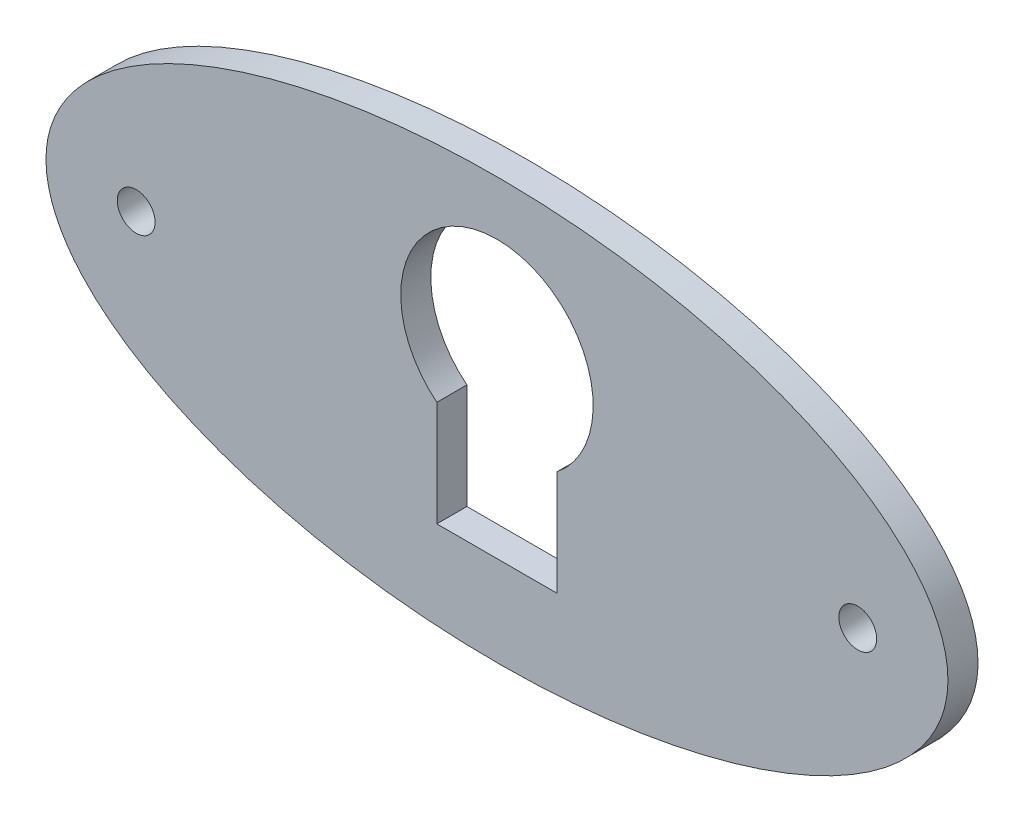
ISO-10303-21;
HEADER;
FILE_DESCRIPTION(('STEP AP214'),'2;1');
FILE_NAME('part.step','',(''),(''),'','','');
FILE_SCHEMA(('AUTOMOTIVE_DESIGN { 1 0 10303 214 1 1 1 1 }'));
ENDSEC;
DATA;
#1=APPLICATION_CONTEXT('core data for automotive mechanical design processes');
#2=APPLICATION_PROTOCOL_DEFINITION('international standard','automotive_design',2000,#1);
#3=PRODUCT_CONTEXT('',#1,'mechanical');
#4=PRODUCT('Part','Part','',(#3));
#5=PRODUCT_RELATED_PRODUCT_CATEGORY('part','',(#4));
#6=PRODUCT_DEFINITION_FORMATION('','',#4);
#7=PRODUCT_DEFINITION_CONTEXT('part definition',#1,'design');
#8=PRODUCT_DEFINITION('design','',#6,#7);
#9=PRODUCT_DEFINITION_SHAPE('','',#8);
#10=(LENGTH_UNIT() NAMED_UNIT(*) SI_UNIT(.MILLI.,.METRE.));
#11=(NAMED_UNIT(*) PLANE_ANGLE_UNIT() SI_UNIT($,.RADIAN.));
#12=(NAMED_UNIT(*) SI_UNIT($,.STERADIAN.) SOLID_ANGLE_UNIT());
#13=UNCERTAINTY_MEASURE_WITH_UNIT(LENGTH_MEASURE(1.E-05),#10,'distance_accuracy_value','');
#14=(GEOMETRIC_REPRESENTATION_CONTEXT(3) GLOBAL_UNCERTAINTY_ASSIGNED_CONTEXT((#13)) GLOBAL_UNIT_ASSIGNED_CONTEXT((#10,
#11,#12)) REPRESENTATION_CONTEXT('',''));
#15=CARTESIAN_POINT('',(0.,0.,0.));
#16=DIRECTION('',(0.,0.,1.));
#17=DIRECTION('',(1.,0.,0.));
#18=AXIS2_PLACEMENT_3D('',#15,#16,#17);
#19=CARTESIAN_POINT('',(0.,0.,-0.79375));
#20=DIRECTION('',(0.,0.,1.));
#21=DIRECTION('',(1.,0.,0.));
#22=AXIS2_PLACEMENT_3D('',#19,#20,#21);
#23=ELLIPSE('',#22,11.90625,5.55625);
#24=DIRECTION('',(0.,0.,1.));
#25=VECTOR('',#24,1.);
#26=SURFACE_OF_LINEAR_EXTRUSION('',#23,#25);
#27=CARTESIAN_POINT('',(11.90625,0.,-0.79375));
#28=VERTEX_POINT('',#27);
#29=EDGE_CURVE('E11',#28,#28,#23,.T.);
#30=ORIENTED_EDGE('',*,*,#29,.T.);
#31=EDGE_LOOP('',(#30));
#32=FACE_BOUND('',#31,.T.);
#33=CARTESIAN_POINT('',(0.,0.,0.));
#34=DIRECTION('',(0.,0.,1.));
#35=DIRECTION('',(1.,0.,0.));
#36=AXIS2_PLACEMENT_3D('',#33,#34,#35);
#37=ELLIPSE('',#36,11.90625,5.55625);
#38=CARTESIAN_POINT('',(11.90625,0.,0.));
#39=VERTEX_POINT('',#38);
#40=EDGE_CURVE('E36',#39,#39,#37,.T.);
#41=ORIENTED_EDGE('',*,*,#40,.F.);
#42=EDGE_LOOP('',(#41));
#43=FACE_BOUND('',#42,.T.);
#44=ADVANCED_FACE('F32',(#32,#43),#26,.T.);
#45=CARTESIAN_POINT('',(0.,0.,-0.79375));
#46=DIRECTION('',(0.,0.,1.));
#47=DIRECTION('',(1.,0.,0.));
#48=AXIS2_PLACEMENT_3D('',#45,#46,#47);
#49=PLANE('',#48);
#50=CARTESIAN_POINT('',(-9.525,0.,-0.79375));
#51=DIRECTION('',(0.,0.,1.));
#52=DIRECTION('',(1.,0.,0.));
#53=AXIS2_PLACEMENT_3D('',#50,#51,#52);
#54=CIRCLE('',#53,0.499999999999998);
#55=CARTESIAN_POINT('',(-9.025,0.,-0.79375));
#56=VERTEX_POINT('',#55);
#57=EDGE_CURVE('E165',#56,#56,#54,.T.);
#58=ORIENTED_EDGE('',*,*,#57,.T.);
#59=EDGE_LOOP('',(#58));
#60=FACE_BOUND('',#59,.T.);
#61=CARTESIAN_POINT('',(9.525,0.,-0.79375));
#62=DIRECTION('',(0.,0.,1.));
#63=DIRECTION('',(1.,0.,0.));
#64=AXIS2_PLACEMENT_3D('',#61,#62,#63);
#65=CIRCLE('',#64,0.499999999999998);
#66=CARTESIAN_POINT('',(10.025,0.,-0.79375));
#67=VERTEX_POINT('',#66);
#68=EDGE_CURVE('E96',#67,#67,#65,.T.);
#69=ORIENTED_EDGE('',*,*,#68,.T.);
#70=EDGE_LOOP('',(#69));
#71=FACE_BOUND('',#70,.T.);
#72=DIRECTION('',(0.,1.,0.));
#73=VECTOR('',#72,1.);
#74=CARTESIAN_POINT('',(1.5875,-0.395286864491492,-0.79375));
#75=LINE('',#74,#73);
#76=CARTESIAN_POINT('',(1.5875,-3.175,-0.79375));
#77=VERTEX_POINT('',#76);
#78=CARTESIAN_POINT('',(1.5875,-0.395286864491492,-0.79375));
#79=VERTEX_POINT('',#78);
#80=EDGE_CURVE('E80',#77,#79,#75,.T.);
#81=ORIENTED_EDGE('',*,*,#80,.T.);
#82=CARTESIAN_POINT('',(0.,1.5875,-0.79375));
#83=DIRECTION('',(0.,0.,1.));
#84=DIRECTION('',(1.,0.,0.));
#85=AXIS2_PLACEMENT_3D('',#82,#83,#84);
#86=CIRCLE('',#85,2.54);
#87=CARTESIAN_POINT('',(-1.5875,-0.395286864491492,-0.79375));
#88=VERTEX_POINT('',#87);
#89=EDGE_CURVE('E74',#79,#88,#86,.T.);
#90=ORIENTED_EDGE('',*,*,#89,.T.);
#91=DIRECTION('',(0.,-1.,0.));
#92=VECTOR('',#91,1.);
#93=CARTESIAN_POINT('',(-1.5875,-0.395286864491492,-0.79375));
#94=LINE('',#93,#92);
#95=CARTESIAN_POINT('',(-1.5875,-3.175,-0.79375));
#96=VERTEX_POINT('',#95);
#97=EDGE_CURVE('E83',#88,#96,#94,.T.);
#98=ORIENTED_EDGE('',*,*,#97,.T.);
#99=DIRECTION('',(1.,0.,0.));
#100=VECTOR('',#99,1.);
#101=CARTESIAN_POINT('',(1.5875,-3.175,-0.79375));
#102=LINE('',#101,#100);
#103=EDGE_CURVE('E46',#96,#77,#102,.T.);
#104=ORIENTED_EDGE('',*,*,#103,.T.);
#105=EDGE_LOOP('',(#81,#90,#98,#104));
#106=FACE_BOUND('',#105,.T.);
#107=ORIENTED_EDGE('',*,*,#29,.F.);
#108=EDGE_LOOP('',(#107));
#109=FACE_BOUND('',#108,.T.);
#110=ADVANCED_FACE('F87',(#60,#71,#106,#109),#49,.F.);
#111=CARTESIAN_POINT('',(0.,0.,0.));
#112=DIRECTION('',(0.,0.,1.));
#113=DIRECTION('',(1.,0.,0.));
#114=AXIS2_PLACEMENT_3D('',#111,#112,#113);
#115=PLANE('',#114);
#116=CARTESIAN_POINT('',(-9.525,0.,0.));
#117=DIRECTION('',(0.,0.,1.));
#118=DIRECTION('',(1.,0.,0.));
#119=AXIS2_PLACEMENT_3D('',#116,#117,#118);
#120=CIRCLE('',#119,0.499999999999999);
#121=CARTESIAN_POINT('',(-9.025,0.,0.));
#122=VERTEX_POINT('',#121);
#123=EDGE_CURVE('E167',#122,#122,#120,.T.);
#124=ORIENTED_EDGE('',*,*,#123,.F.);
#125=EDGE_LOOP('',(#124));
#126=FACE_BOUND('',#125,.T.);
#127=CARTESIAN_POINT('',(9.525,0.,0.));
#128=DIRECTION('',(0.,0.,1.));
#129=DIRECTION('',(1.,0.,0.));
#130=AXIS2_PLACEMENT_3D('',#127,#128,#129);
#131=CIRCLE('',#130,0.499999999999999);
#132=CARTESIAN_POINT('',(10.025,0.,0.));
#133=VERTEX_POINT('',#132);
#134=EDGE_CURVE('E161',#133,#133,#131,.T.);
#135=ORIENTED_EDGE('',*,*,#134,.F.);
#136=EDGE_LOOP('',(#135));
#137=FACE_BOUND('',#136,.T.);
#138=CARTESIAN_POINT('',(0.,1.5875,0.));
#139=DIRECTION('',(0.,0.,1.));
#140=DIRECTION('',(1.,0.,0.));
#141=AXIS2_PLACEMENT_3D('',#138,#139,#140);
#142=CIRCLE('',#141,2.54);
#143=CARTESIAN_POINT('',(1.5875,-0.395286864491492,0.));
#144=VERTEX_POINT('',#143);
#145=CARTESIAN_POINT('',(-1.5875,-0.395286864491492,0.));
#146=VERTEX_POINT('',#145);
#147=EDGE_CURVE('E54',#144,#146,#142,.T.);
#148=ORIENTED_EDGE('',*,*,#147,.F.);
#149=DIRECTION('',(0.,1.,0.));
#150=VECTOR('',#149,1.);
#151=CARTESIAN_POINT('',(1.5875,-0.395286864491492,0.));
#152=LINE('',#151,#150);
#153=CARTESIAN_POINT('',(1.5875,-3.175,0.));
#154=VERTEX_POINT('',#153);
#155=EDGE_CURVE('E90',#154,#144,#152,.T.);
#156=ORIENTED_EDGE('',*,*,#155,.F.);
#157=DIRECTION('',(1.,0.,0.));
#158=VECTOR('',#157,1.);
#159=CARTESIAN_POINT('',(1.5875,-3.175,0.));
#160=LINE('',#159,#158);
#161=CARTESIAN_POINT('',(-1.5875,-3.175,0.));
#162=VERTEX_POINT('',#161);
#163=EDGE_CURVE('E93',#162,#154,#160,.T.);
#164=ORIENTED_EDGE('',*,*,#163,.F.);
#165=DIRECTION('',(0.,-1.,0.));
#166=VECTOR('',#165,1.);
#167=CARTESIAN_POINT('',(-1.5875,-0.395286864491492,0.));
#168=LINE('',#167,#166);
#169=EDGE_CURVE('E102',#146,#162,#168,.T.);
#170=ORIENTED_EDGE('',*,*,#169,.F.);
#171=EDGE_LOOP('',(#148,#156,#164,#170));
#172=FACE_BOUND('',#171,.T.);
#173=ORIENTED_EDGE('',*,*,#40,.T.);
#174=EDGE_LOOP('',(#173));
#175=FACE_BOUND('',#174,.T.);
#176=ADVANCED_FACE('F115',(#126,#137,#172,#175),#115,.T.);
#177=CARTESIAN_POINT('',(0.,1.5875,-0.79375));
#178=DIRECTION('',(0.,0.,1.));
#179=DIRECTION('',(1.,0.,0.));
#180=AXIS2_PLACEMENT_3D('',#177,#178,#179);
#181=CYLINDRICAL_SURFACE('',#180,2.54);
#182=ORIENTED_EDGE('',*,*,#147,.T.);
#183=DIRECTION('',(0.,0.,1.));
#184=VECTOR('',#183,1.);
#185=CARTESIAN_POINT('',(-1.5875,-0.395286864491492,-0.79375));
#186=LINE('',#185,#184);
#187=EDGE_CURVE('E70',#88,#146,#186,.T.);
#188=ORIENTED_EDGE('',*,*,#187,.F.);
#189=ORIENTED_EDGE('',*,*,#89,.F.);
#190=DIRECTION('',(0.,0.,1.));
#191=VECTOR('',#190,1.);
#192=CARTESIAN_POINT('',(1.5875,-0.395286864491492,-0.79375));
#193=LINE('',#192,#191);
#194=EDGE_CURVE('E106',#79,#144,#193,.T.);
#195=ORIENTED_EDGE('',*,*,#194,.T.);
#196=EDGE_LOOP('',(#182,#188,#189,#195));
#197=FACE_BOUND('',#196,.T.);
#198=ADVANCED_FACE('F72',(#197),#181,.F.);
#199=CARTESIAN_POINT('',(1.5875,-0.395286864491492,-0.79375));
#200=DIRECTION('',(1.,0.,0.));
#201=DIRECTION('',(0.,1.,0.));
#202=AXIS2_PLACEMENT_3D('',#199,#200,#201);
#203=PLANE('',#202);
#204=ORIENTED_EDGE('',*,*,#155,.T.);
#205=ORIENTED_EDGE('',*,*,#194,.F.);
#206=ORIENTED_EDGE('',*,*,#80,.F.);
#207=DIRECTION('',(0.,0.,1.));
#208=VECTOR('',#207,1.);
#209=CARTESIAN_POINT('',(1.5875,-3.175,-0.79375));
#210=LINE('',#209,#208);
#211=EDGE_CURVE('E108',#77,#154,#210,.T.);
#212=ORIENTED_EDGE('',*,*,#211,.T.);
#213=EDGE_LOOP('',(#204,#205,#206,#212));
#214=FACE_BOUND('',#213,.T.);
#215=ADVANCED_FACE('F118',(#214),#203,.F.);
#216=CARTESIAN_POINT('',(1.5875,-3.175,-0.79375));
#217=DIRECTION('',(0.,-1.,0.));
#218=DIRECTION('',(1.,0.,0.));
#219=AXIS2_PLACEMENT_3D('',#216,#217,#218);
#220=PLANE('',#219);
#221=ORIENTED_EDGE('',*,*,#163,.T.);
#222=ORIENTED_EDGE('',*,*,#211,.F.);
#223=ORIENTED_EDGE('',*,*,#103,.F.);
#224=DIRECTION('',(0.,0.,1.));
#225=VECTOR('',#224,1.);
#226=CARTESIAN_POINT('',(-1.5875,-3.175,-0.79375));
#227=LINE('',#226,#225);
#228=EDGE_CURVE('E79',#96,#162,#227,.T.);
#229=ORIENTED_EDGE('',*,*,#228,.T.);
#230=EDGE_LOOP('',(#221,#222,#223,#229));
#231=FACE_BOUND('',#230,.T.);
#232=ADVANCED_FACE('F111',(#231),#220,.F.);
#233=CARTESIAN_POINT('',(-1.5875,-0.395286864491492,-0.79375));
#234=DIRECTION('',(-1.,0.,0.));
#235=DIRECTION('',(0.,-1.,0.));
#236=AXIS2_PLACEMENT_3D('',#233,#234,#235);
#237=PLANE('',#236);
#238=ORIENTED_EDGE('',*,*,#169,.T.);
#239=ORIENTED_EDGE('',*,*,#228,.F.);
#240=ORIENTED_EDGE('',*,*,#97,.F.);
#241=ORIENTED_EDGE('',*,*,#187,.T.);
#242=EDGE_LOOP('',(#238,#239,#240,#241));
#243=FACE_BOUND('',#242,.T.);
#244=ADVANCED_FACE('F84',(#243),#237,.F.);
#245=CARTESIAN_POINT('',(9.525,0.,0.));
#246=DIRECTION('',(0.,0.,1.));
#247=DIRECTION('',(1.,0.,0.));
#248=AXIS2_PLACEMENT_3D('',#245,#246,#247);
#249=CYLINDRICAL_SURFACE('',#248,0.499999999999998);
#250=ORIENTED_EDGE('',*,*,#134,.T.);
#251=EDGE_LOOP('',(#250));
#252=FACE_BOUND('',#251,.T.);
#253=ORIENTED_EDGE('',*,*,#68,.F.);
#254=EDGE_LOOP('',(#253));
#255=FACE_BOUND('',#254,.T.);
#256=ADVANCED_FACE('F147',(#252,#255),#249,.F.);
#257=CARTESIAN_POINT('',(-9.525,0.,0.));
#258=DIRECTION('',(0.,0.,1.));
#259=DIRECTION('',(1.,0.,0.));
#260=AXIS2_PLACEMENT_3D('',#257,#258,#259);
#261=CYLINDRICAL_SURFACE('',#260,0.499999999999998);
#262=ORIENTED_EDGE('',*,*,#123,.T.);
#263=EDGE_LOOP('',(#262));
#264=FACE_BOUND('',#263,.T.);
#265=ORIENTED_EDGE('',*,*,#57,.F.);
#266=EDGE_LOOP('',(#265));
#267=FACE_BOUND('',#266,.T.);
#268=ADVANCED_FACE('F151',(#264,#267),#261,.F.);
#269=CLOSED_SHELL('',(#44,#110,#176,#198,#215,#232,#244,#256,#268));
#270=MANIFOLD_SOLID_BREP('B2',#269);
#271=ADVANCED_BREP_SHAPE_REPRESENTATION('',(#18,#270),#14);
#272=SHAPE_DEFINITION_REPRESENTATION(#9,#271);
ENDSEC;
END-ISO-10303-21;
